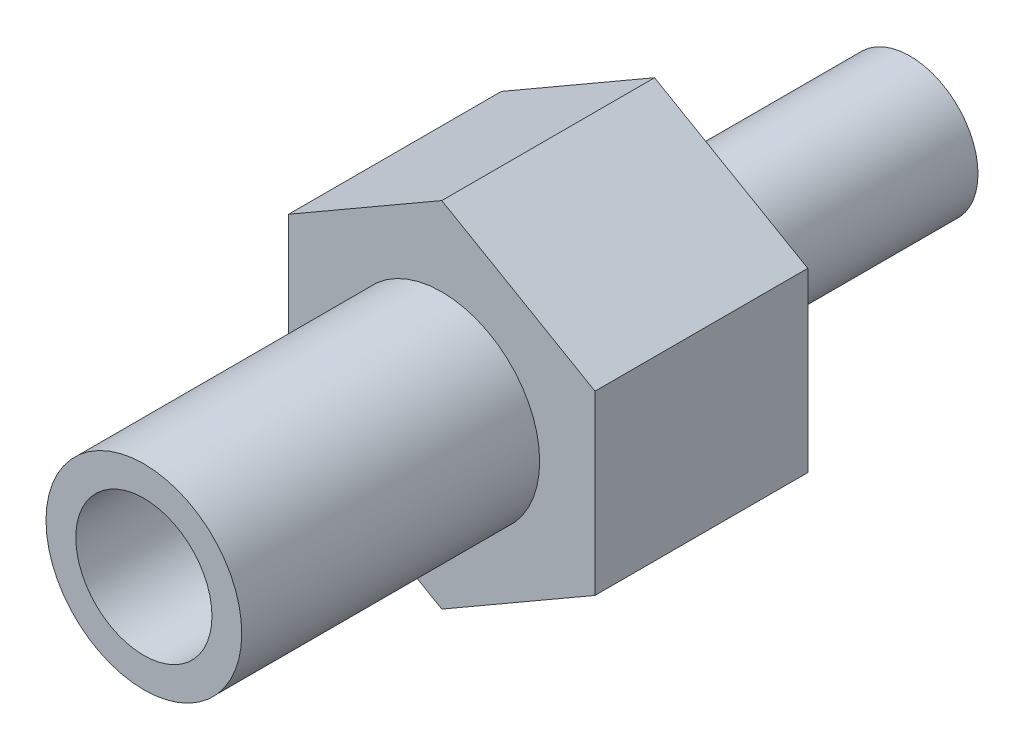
ISO-10303-21;
HEADER;
FILE_DESCRIPTION(('STEP AP214'),'2;1');
FILE_NAME('part.step','',(''),(''),'','','');
FILE_SCHEMA(('AUTOMOTIVE_DESIGN { 1 0 10303 214 1 1 1 1 }'));
ENDSEC;
DATA;
#1=APPLICATION_CONTEXT('core data for automotive mechanical design processes');
#2=APPLICATION_PROTOCOL_DEFINITION('international standard','automotive_design',2000,#1);
#3=PRODUCT_CONTEXT('',#1,'mechanical');
#4=PRODUCT('Part','Part','',(#3));
#5=PRODUCT_RELATED_PRODUCT_CATEGORY('part','',(#4));
#6=PRODUCT_DEFINITION_FORMATION('','',#4);
#7=PRODUCT_DEFINITION_CONTEXT('part definition',#1,'design');
#8=PRODUCT_DEFINITION('design','',#6,#7);
#9=PRODUCT_DEFINITION_SHAPE('','',#8);
#10=(LENGTH_UNIT() NAMED_UNIT(*) SI_UNIT(.MILLI.,.METRE.));
#11=(NAMED_UNIT(*) PLANE_ANGLE_UNIT() SI_UNIT($,.RADIAN.));
#12=(NAMED_UNIT(*) SI_UNIT($,.STERADIAN.) SOLID_ANGLE_UNIT());
#13=UNCERTAINTY_MEASURE_WITH_UNIT(LENGTH_MEASURE(1.E-05),#10,'distance_accuracy_value','');
#14=(GEOMETRIC_REPRESENTATION_CONTEXT(3) GLOBAL_UNCERTAINTY_ASSIGNED_CONTEXT((#13)) GLOBAL_UNIT_ASSIGNED_CONTEXT((#10,
#11,#12)) REPRESENTATION_CONTEXT('',''));
#15=CARTESIAN_POINT('',(0.,0.,0.));
#16=DIRECTION('',(0.,0.,1.));
#17=DIRECTION('',(1.,0.,0.));
#18=AXIS2_PLACEMENT_3D('',#15,#16,#17);
#19=CARTESIAN_POINT('',(8.,0.,26.));
#20=DIRECTION('',(0.,0.,-1.));
#21=DIRECTION('',(-1.,0.,0.));
#22=AXIS2_PLACEMENT_3D('',#19,#20,#21);
#23=PLANE('',#22);
#24=CARTESIAN_POINT('',(0.,0.,26.));
#25=DIRECTION('',(0.,0.,1.));
#26=DIRECTION('',(1.,0.,0.));
#27=AXIS2_PLACEMENT_3D('',#24,#25,#26);
#28=CIRCLE('',#27,8.);
#29=CARTESIAN_POINT('',(8.00000000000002,0.,26.));
#30=VERTEX_POINT('',#29);
#31=EDGE_CURVE('E127',#30,#30,#28,.T.);
#32=ORIENTED_EDGE('',*,*,#31,.T.);
#33=EDGE_LOOP('',(#32));
#34=FACE_BOUND('',#33,.T.);
#35=ADVANCED_FACE('F15',(#34),#23,.F.);
#36=CARTESIAN_POINT('',(0.,0.,65.));
#37=DIRECTION('',(0.,0.,1.));
#38=DIRECTION('',(1.,0.,0.));
#39=AXIS2_PLACEMENT_3D('',#36,#37,#38);
#40=CYLINDRICAL_SURFACE('',#39,8.);
#41=ORIENTED_EDGE('',*,*,#31,.F.);
#42=EDGE_LOOP('',(#41));
#43=FACE_BOUND('',#42,.T.);
#44=CARTESIAN_POINT('',(0.,0.,60.));
#45=DIRECTION('',(0.,0.,1.));
#46=DIRECTION('',(1.,0.,0.));
#47=AXIS2_PLACEMENT_3D('',#44,#45,#46);
#48=CIRCLE('',#47,8.);
#49=CARTESIAN_POINT('',(8.00000000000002,0.,60.));
#50=VERTEX_POINT('',#49);
#51=EDGE_CURVE('E124',#50,#50,#48,.T.);
#52=ORIENTED_EDGE('',*,*,#51,.T.);
#53=EDGE_LOOP('',(#52));
#54=FACE_BOUND('',#53,.T.);
#55=ADVANCED_FACE('F150',(#43,#54),#40,.F.);
#56=CARTESIAN_POINT('',(11.5,0.,60.));
#57=DIRECTION('',(0.,0.,-1.));
#58=DIRECTION('',(-1.,0.,0.));
#59=AXIS2_PLACEMENT_3D('',#56,#57,#58);
#60=PLANE('',#59);
#61=ORIENTED_EDGE('',*,*,#51,.F.);
#62=EDGE_LOOP('',(#61));
#63=FACE_BOUND('',#62,.T.);
#64=CARTESIAN_POINT('',(0.,0.,60.));
#65=DIRECTION('',(0.,0.,1.));
#66=DIRECTION('',(1.,0.,0.));
#67=AXIS2_PLACEMENT_3D('',#64,#65,#66);
#68=CIRCLE('',#67,11.5);
#69=CARTESIAN_POINT('',(11.5,0.,60.));
#70=VERTEX_POINT('',#69);
#71=EDGE_CURVE('E121',#70,#70,#68,.T.);
#72=ORIENTED_EDGE('',*,*,#71,.T.);
#73=EDGE_LOOP('',(#72));
#74=FACE_BOUND('',#73,.T.);
#75=ADVANCED_FACE('F156',(#63,#74),#60,.F.);
#76=CARTESIAN_POINT('',(0.,0.,65.));
#77=DIRECTION('',(0.,0.,1.));
#78=DIRECTION('',(1.,0.,0.));
#79=AXIS2_PLACEMENT_3D('',#76,#77,#78);
#80=CYLINDRICAL_SURFACE('',#79,11.5);
#81=ORIENTED_EDGE('',*,*,#71,.F.);
#82=EDGE_LOOP('',(#81));
#83=FACE_BOUND('',#82,.T.);
#84=CARTESIAN_POINT('',(0.,0.,25.));
#85=DIRECTION('',(0.,0.,1.));
#86=DIRECTION('',(1.,0.,0.));
#87=AXIS2_PLACEMENT_3D('',#84,#85,#86);
#88=CIRCLE('',#87,11.5);
#89=CARTESIAN_POINT('',(11.5,0.,25.));
#90=VERTEX_POINT('',#89);
#91=EDGE_CURVE('E76',#90,#90,#88,.T.);
#92=ORIENTED_EDGE('',*,*,#91,.T.);
#93=EDGE_LOOP('',(#92));
#94=FACE_BOUND('',#93,.T.);
#95=ADVANCED_FACE('F162',(#83,#94),#80,.T.);
#96=CARTESIAN_POINT('',(22.,0.,25.));
#97=DIRECTION('',(0.,0.,-1.));
#98=DIRECTION('',(-1.,0.,0.));
#99=AXIS2_PLACEMENT_3D('',#96,#97,#98);
#100=PLANE('',#99);
#101=DIRECTION('',(-0.866025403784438,0.5,0.));
#102=VECTOR('',#101,1.);
#103=CARTESIAN_POINT('',(0.,-20.7846096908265,25.));
#104=LINE('',#103,#102);
#105=CARTESIAN_POINT('',(0.,-20.7846096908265,25.));
#106=VERTEX_POINT('',#105);
#107=CARTESIAN_POINT('',(-18.,-10.3923048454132,25.));
#108=VERTEX_POINT('',#107);
#109=EDGE_CURVE('E96',#106,#108,#104,.T.);
#110=ORIENTED_EDGE('',*,*,#109,.F.);
#111=DIRECTION('',(0.866025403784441,0.5,0.));
#112=VECTOR('',#111,1.);
#113=CARTESIAN_POINT('',(0.,-20.7846096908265,25.));
#114=LINE('',#113,#112);
#115=CARTESIAN_POINT('',(18.,-10.3923048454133,25.));
#116=VERTEX_POINT('',#115);
#117=EDGE_CURVE('E38',#106,#116,#114,.T.);
#118=ORIENTED_EDGE('',*,*,#117,.T.);
#119=DIRECTION('',(0.,-1.,0.));
#120=VECTOR('',#119,1.);
#121=CARTESIAN_POINT('',(18.,10.3923048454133,25.));
#122=LINE('',#121,#120);
#123=CARTESIAN_POINT('',(18.,10.3923048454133,25.));
#124=VERTEX_POINT('',#123);
#125=EDGE_CURVE('E75',#124,#116,#122,.T.);
#126=ORIENTED_EDGE('',*,*,#125,.F.);
#127=DIRECTION('',(0.866025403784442,-0.5,0.));
#128=VECTOR('',#127,1.);
#129=CARTESIAN_POINT('',(0.,20.7846096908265,25.));
#130=LINE('',#129,#128);
#131=CARTESIAN_POINT('',(0.,20.7846096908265,25.));
#132=VERTEX_POINT('',#131);
#133=EDGE_CURVE('E105',#132,#124,#130,.T.);
#134=ORIENTED_EDGE('',*,*,#133,.F.);
#135=DIRECTION('',(-0.866025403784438,-0.5,0.));
#136=VECTOR('',#135,1.);
#137=CARTESIAN_POINT('',(0.,20.7846096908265,25.));
#138=LINE('',#137,#136);
#139=CARTESIAN_POINT('',(-18.,10.3923048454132,25.));
#140=VERTEX_POINT('',#139);
#141=EDGE_CURVE('E102',#132,#140,#138,.T.);
#142=ORIENTED_EDGE('',*,*,#141,.T.);
#143=DIRECTION('',(0.,-1.,0.));
#144=VECTOR('',#143,1.);
#145=CARTESIAN_POINT('',(-18.,10.3923048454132,25.));
#146=LINE('',#145,#144);
#147=EDGE_CURVE('E99',#140,#108,#146,.T.);
#148=ORIENTED_EDGE('',*,*,#147,.T.);
#149=EDGE_LOOP('',(#110,#118,#126,#134,#142,#148));
#150=FACE_BOUND('',#149,.T.);
#151=ORIENTED_EDGE('',*,*,#91,.F.);
#152=EDGE_LOOP('',(#151));
#153=FACE_BOUND('',#152,.T.);
#154=ADVANCED_FACE('F166',(#150,#153),#100,.F.);
#155=CARTESIAN_POINT('',(0.,-20.7846096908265,25.));
#156=DIRECTION('',(-0.5,0.866025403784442,0.));
#157=DIRECTION('',(-0.866025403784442,-0.5,0.));
#158=AXIS2_PLACEMENT_3D('',#155,#156,#157);
#159=PLANE('',#158);
#160=DIRECTION('',(0.,0.,-1.));
#161=VECTOR('',#160,1.);
#162=CARTESIAN_POINT('',(18.,-10.3923048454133,25.));
#163=LINE('',#162,#161);
#164=CARTESIAN_POINT('',(18.,-10.3923048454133,0.));
#165=VERTEX_POINT('',#164);
#166=EDGE_CURVE('E68',#116,#165,#163,.T.);
#167=ORIENTED_EDGE('',*,*,#166,.F.);
#168=ORIENTED_EDGE('',*,*,#117,.F.);
#169=DIRECTION('',(0.,0.,-1.));
#170=VECTOR('',#169,1.);
#171=CARTESIAN_POINT('',(0.,-20.7846096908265,25.));
#172=LINE('',#171,#170);
#173=CARTESIAN_POINT('',(0.,-20.7846096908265,0.));
#174=VERTEX_POINT('',#173);
#175=EDGE_CURVE('E82',#106,#174,#172,.T.);
#176=ORIENTED_EDGE('',*,*,#175,.T.);
#177=DIRECTION('',(0.866025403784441,0.5,0.));
#178=VECTOR('',#177,1.);
#179=CARTESIAN_POINT('',(0.,-20.7846096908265,0.));
#180=LINE('',#179,#178);
#181=EDGE_CURVE('E80',#174,#165,#180,.T.);
#182=ORIENTED_EDGE('',*,*,#181,.T.);
#183=EDGE_LOOP('',(#167,#168,#176,#182));
#184=FACE_BOUND('',#183,.T.);
#185=ADVANCED_FACE('F81',(#184),#159,.F.);
#186=CARTESIAN_POINT('',(18.,10.3923048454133,25.));
#187=DIRECTION('',(1.,0.,0.));
#188=DIRECTION('',(0.,1.,0.));
#189=AXIS2_PLACEMENT_3D('',#186,#187,#188);
#190=PLANE('',#189);
#191=DIRECTION('',(0.,0.,-1.));
#192=VECTOR('',#191,1.);
#193=CARTESIAN_POINT('',(18.,10.3923048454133,25.));
#194=LINE('',#193,#192);
#195=CARTESIAN_POINT('',(18.,10.3923048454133,0.));
#196=VERTEX_POINT('',#195);
#197=EDGE_CURVE('E77',#124,#196,#194,.T.);
#198=ORIENTED_EDGE('',*,*,#197,.F.);
#199=ORIENTED_EDGE('',*,*,#125,.T.);
#200=ORIENTED_EDGE('',*,*,#166,.T.);
#201=DIRECTION('',(0.,-1.,0.));
#202=VECTOR('',#201,1.);
#203=CARTESIAN_POINT('',(18.,10.3923048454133,0.));
#204=LINE('',#203,#202);
#205=EDGE_CURVE('E72',#196,#165,#204,.T.);
#206=ORIENTED_EDGE('',*,*,#205,.F.);
#207=EDGE_LOOP('',(#198,#199,#200,#206));
#208=FACE_BOUND('',#207,.T.);
#209=ADVANCED_FACE('F70',(#208),#190,.T.);
#210=CARTESIAN_POINT('',(0.,20.7846096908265,25.));
#211=DIRECTION('',(0.5,0.866025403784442,0.));
#212=DIRECTION('',(-0.866025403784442,0.5,0.));
#213=AXIS2_PLACEMENT_3D('',#210,#211,#212);
#214=PLANE('',#213);
#215=DIRECTION('',(0.,0.,-1.));
#216=VECTOR('',#215,1.);
#217=CARTESIAN_POINT('',(0.,20.7846096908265,25.));
#218=LINE('',#217,#216);
#219=CARTESIAN_POINT('',(0.,20.7846096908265,0.));
#220=VERTEX_POINT('',#219);
#221=EDGE_CURVE('E116',#132,#220,#218,.T.);
#222=ORIENTED_EDGE('',*,*,#221,.F.);
#223=ORIENTED_EDGE('',*,*,#133,.T.);
#224=ORIENTED_EDGE('',*,*,#197,.T.);
#225=DIRECTION('',(0.866025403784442,-0.5,0.));
#226=VECTOR('',#225,1.);
#227=CARTESIAN_POINT('',(0.,20.7846096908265,0.));
#228=LINE('',#227,#226);
#229=EDGE_CURVE('E90',#220,#196,#228,.T.);
#230=ORIENTED_EDGE('',*,*,#229,.F.);
#231=EDGE_LOOP('',(#222,#223,#224,#230));
#232=FACE_BOUND('',#231,.T.);
#233=ADVANCED_FACE('F173',(#232),#214,.T.);
#234=CARTESIAN_POINT('',(0.,20.7846096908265,25.));
#235=DIRECTION('',(0.5,-0.866025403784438,0.));
#236=DIRECTION('',(0.866025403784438,0.5,0.));
#237=AXIS2_PLACEMENT_3D('',#234,#235,#236);
#238=PLANE('',#237);
#239=DIRECTION('',(0.,0.,-1.));
#240=VECTOR('',#239,1.);
#241=CARTESIAN_POINT('',(-18.,10.3923048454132,25.));
#242=LINE('',#241,#240);
#243=CARTESIAN_POINT('',(-18.,10.3923048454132,0.));
#244=VERTEX_POINT('',#243);
#245=EDGE_CURVE('E114',#140,#244,#242,.T.);
#246=ORIENTED_EDGE('',*,*,#245,.F.);
#247=ORIENTED_EDGE('',*,*,#141,.F.);
#248=ORIENTED_EDGE('',*,*,#221,.T.);
#249=DIRECTION('',(-0.866025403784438,-0.5,0.));
#250=VECTOR('',#249,1.);
#251=CARTESIAN_POINT('',(0.,20.7846096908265,0.));
#252=LINE('',#251,#250);
#253=EDGE_CURVE('E92',#220,#244,#252,.T.);
#254=ORIENTED_EDGE('',*,*,#253,.T.);
#255=EDGE_LOOP('',(#246,#247,#248,#254));
#256=FACE_BOUND('',#255,.T.);
#257=ADVANCED_FACE('F176',(#256),#238,.F.);
#258=CARTESIAN_POINT('',(-18.,10.3923048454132,25.));
#259=DIRECTION('',(1.,0.,0.));
#260=DIRECTION('',(0.,1.,0.));
#261=AXIS2_PLACEMENT_3D('',#258,#259,#260);
#262=PLANE('',#261);
#263=DIRECTION('',(0.,0.,-1.));
#264=VECTOR('',#263,1.);
#265=CARTESIAN_POINT('',(-18.,-10.3923048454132,25.));
#266=LINE('',#265,#264);
#267=CARTESIAN_POINT('',(-18.,-10.3923048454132,0.));
#268=VERTEX_POINT('',#267);
#269=EDGE_CURVE('E112',#108,#268,#266,.T.);
#270=ORIENTED_EDGE('',*,*,#269,.F.);
#271=ORIENTED_EDGE('',*,*,#147,.F.);
#272=ORIENTED_EDGE('',*,*,#245,.T.);
#273=DIRECTION('',(0.,-1.,0.));
#274=VECTOR('',#273,1.);
#275=CARTESIAN_POINT('',(-18.,10.3923048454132,0.));
#276=LINE('',#275,#274);
#277=EDGE_CURVE('E30',#244,#268,#276,.T.);
#278=ORIENTED_EDGE('',*,*,#277,.T.);
#279=EDGE_LOOP('',(#270,#271,#272,#278));
#280=FACE_BOUND('',#279,.T.);
#281=ADVANCED_FACE('F145',(#280),#262,.F.);
#282=CARTESIAN_POINT('',(0.,-20.7846096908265,25.));
#283=DIRECTION('',(-0.5,-0.866025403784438,0.));
#284=DIRECTION('',(0.866025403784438,-0.5,0.));
#285=AXIS2_PLACEMENT_3D('',#282,#283,#284);
#286=PLANE('',#285);
#287=ORIENTED_EDGE('',*,*,#109,.T.);
#288=ORIENTED_EDGE('',*,*,#269,.T.);
#289=DIRECTION('',(-0.866025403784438,0.5,0.));
#290=VECTOR('',#289,1.);
#291=CARTESIAN_POINT('',(0.,-20.7846096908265,0.));
#292=LINE('',#291,#290);
#293=EDGE_CURVE('E110',#174,#268,#292,.T.);
#294=ORIENTED_EDGE('',*,*,#293,.F.);
#295=ORIENTED_EDGE('',*,*,#175,.F.);
#296=EDGE_LOOP('',(#287,#288,#294,#295));
#297=FACE_BOUND('',#296,.T.);
#298=ADVANCED_FACE('F136',(#297),#286,.T.);
#299=CARTESIAN_POINT('',(0.,0.,-30.));
#300=DIRECTION('',(0.,0.,1.));
#301=DIRECTION('',(1.,0.,0.));
#302=AXIS2_PLACEMENT_3D('',#299,#300,#301);
#303=PLANE('',#302);
#304=CARTESIAN_POINT('',(0.,0.,-30.));
#305=DIRECTION('',(0.,0.,1.));
#306=DIRECTION('',(1.,0.,0.));
#307=AXIS2_PLACEMENT_3D('',#304,#305,#306);
#308=CIRCLE('',#307,8.);
#309=CARTESIAN_POINT('',(8.00000000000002,0.,-30.));
#310=VERTEX_POINT('',#309);
#311=EDGE_CURVE('E23',#310,#310,#308,.T.);
#312=ORIENTED_EDGE('',*,*,#311,.F.);
#313=EDGE_LOOP('',(#312));
#314=FACE_BOUND('',#313,.T.);
#315=ADVANCED_FACE('F134',(#314),#303,.F.);
#316=CARTESIAN_POINT('',(0.,0.,65.));
#317=DIRECTION('',(0.,0.,1.));
#318=DIRECTION('',(1.,0.,0.));
#319=AXIS2_PLACEMENT_3D('',#316,#317,#318);
#320=CYLINDRICAL_SURFACE('',#319,8.);
#321=CARTESIAN_POINT('',(0.,0.,0.));
#322=DIRECTION('',(0.,0.,1.));
#323=DIRECTION('',(1.,0.,0.));
#324=AXIS2_PLACEMENT_3D('',#321,#322,#323);
#325=CIRCLE('',#324,8.);
#326=CARTESIAN_POINT('',(8.00000000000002,0.,0.));
#327=VERTEX_POINT('',#326);
#328=EDGE_CURVE('E9',#327,#327,#325,.T.);
#329=ORIENTED_EDGE('',*,*,#328,.F.);
#330=EDGE_LOOP('',(#329));
#331=FACE_BOUND('',#330,.T.);
#332=ORIENTED_EDGE('',*,*,#311,.T.);
#333=EDGE_LOOP('',(#332));
#334=FACE_BOUND('',#333,.T.);
#335=ADVANCED_FACE('F132',(#331,#334),#320,.T.);
#336=CARTESIAN_POINT('',(8.,0.,0.));
#337=DIRECTION('',(0.,0.,1.));
#338=DIRECTION('',(1.,0.,0.));
#339=AXIS2_PLACEMENT_3D('',#336,#337,#338);
#340=PLANE('',#339);
#341=ORIENTED_EDGE('',*,*,#205,.T.);
#342=ORIENTED_EDGE('',*,*,#181,.F.);
#343=ORIENTED_EDGE('',*,*,#293,.T.);
#344=ORIENTED_EDGE('',*,*,#277,.F.);
#345=ORIENTED_EDGE('',*,*,#253,.F.);
#346=ORIENTED_EDGE('',*,*,#229,.T.);
#347=EDGE_LOOP('',(#341,#342,#343,#344,#345,#346));
#348=FACE_BOUND('',#347,.T.);
#349=ORIENTED_EDGE('',*,*,#328,.T.);
#350=EDGE_LOOP('',(#349));
#351=FACE_BOUND('',#350,.T.);
#352=ADVANCED_FACE('F17',(#348,#351),#340,.F.);
#353=CLOSED_SHELL('',(#35,#55,#75,#95,#154,#185,#209,#233,#257,#281,#298,#315,#335,#352));
#354=MANIFOLD_SOLID_BREP('B1',#353);
#355=ADVANCED_BREP_SHAPE_REPRESENTATION('',(#18,#354),#14);
#356=SHAPE_DEFINITION_REPRESENTATION(#9,#355);
ENDSEC;
END-ISO-10303-21;
